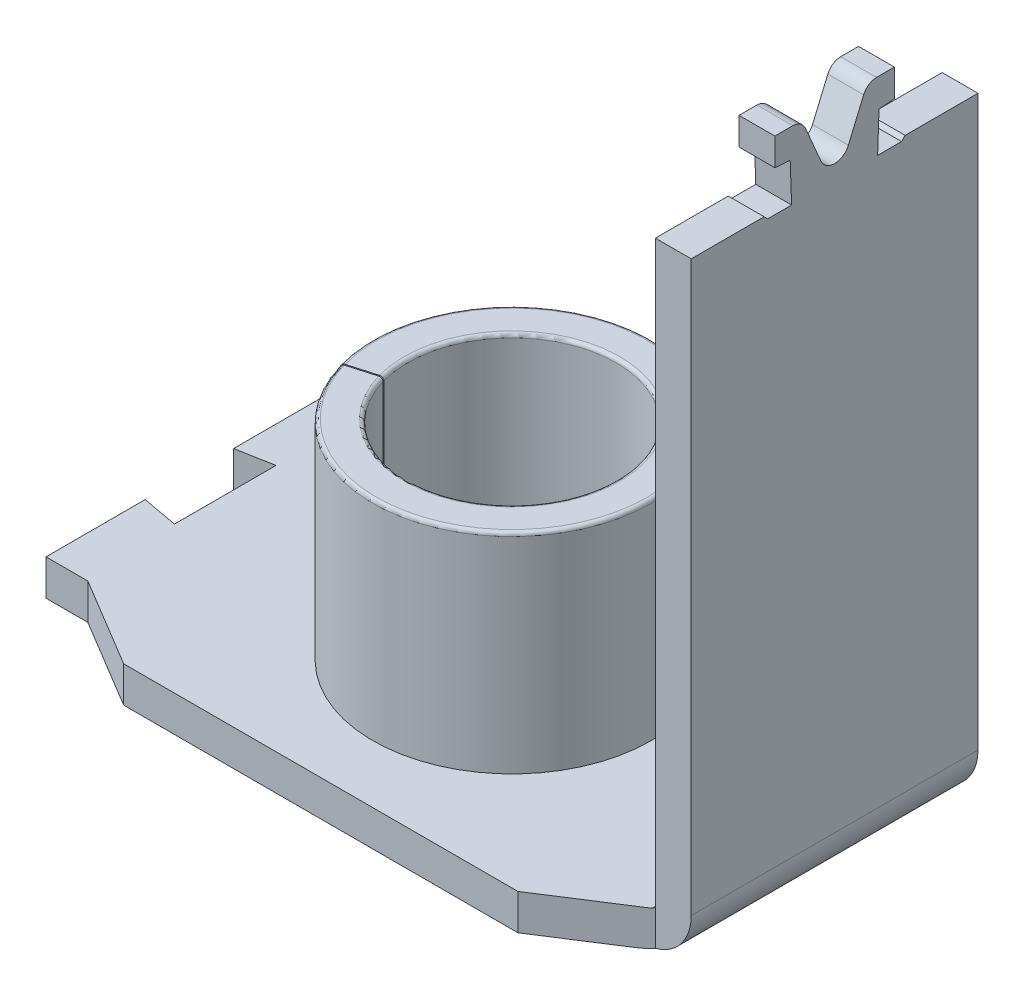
from build123d import *

# Parameters (mm, degrees)
EXTRUSION1_DEPTH             = 16.5
ENL_V_MAT_EXTRU_1_DEPTH      = 79.129699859
ENL_V_MAT_EXTRU_1_DEPTH_BACK = 33
ESQUISSE2_OUTSIDE_W          = 73.034
ESQUISSE2_OUTSIDE_H          = 52.034
ESQUISSE2_OUTSIDE_R          = 11.65
ENL_V_MAT_EXTRU_2_DEPTH      = 79.244808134
EXTRUSION2_START             = -20.5
ESQUISSE5_R                  = 11.65
ESQUISSE5_R_2                = 8.725
EXTRUSION2_DEPTH             = 20.5
CONG_1_R                     = 0.3
ENL_V_START                  = -0.5
ESQUISSE6_R                  = 11.65
ESQUISSE6_R_2                = 11.6
ENL_V_MAT_EXTRU_3_DEPTH      = 0.5
ENL_V_MAT_EXTRU_4_DEPTH      = 81.232474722


with BuildPart() as part:
    # Esquisse1 → Extrusion1 (new, symmetric)
    with BuildSketch(Plane.XY):
        with BuildLine():
            Line((-4, 0), (-54, 0))
            Line((-54, 0), (-54, 3))
            Line((-54, 3), (-3.2, 3))
            ThreePointArc((-3.2, 3), (-3.058578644, 3.058578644), (-3, 3.2))
            Line((-3, 3.2), (-3, 57))
            Line((-3, 57), (0, 57))
            Line((0, 57), (0, 4))
            ThreePointArc((0, 4), (-1.171572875, 1.171572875), (-4, 0))
        make_face()
    extrude(amount=EXTRUSION1_DEPTH, both=True)

    # Esquisse2 outside → Enl_v. mat.-Extru.1 (cut, two sides: drawn at the far end of the back side and taken through both)
    # profile 1 of 2: a face of its own
    with BuildSketch(Plane(origin=(0, 3, 0), x_dir=(-1, 0, 0), z_dir=(0, 1, 0)).offset(-ENL_V_MAT_EXTRU_1_DEPTH_BACK)):
        with Locations((27, 0)):
            Rectangle(ESQUISSE2_OUTSIDE_W, ESQUISSE2_OUTSIDE_H)
        Polygon((3, -12), (10, -16.5), (43, -16.5), (50.49790411, -12), (57, -12), (57, -3.7), (54, -3.7), (51, -4.25), (51, 4.25), (54, 3.7), (57, 3.7), (57, 12), (50.49790411, 12), (43, 16.5), (10, 16.5), (3, 12), (0, 12), (0, -12), align=None, mode=Mode.SUBTRACT)
    # profile 2 of 2: a face of its own
    with BuildSketch(Plane(origin=(0, 3, 0), x_dir=(-1, 0, 0), z_dir=(0, 1, 0)).offset(-ENL_V_MAT_EXTRU_1_DEPTH_BACK)):
        with Locations(Location((27, 0, 0), (0, 0, 180))):
            Circle(ESQUISSE2_OUTSIDE_R)
    extrude(amount=ENL_V_MAT_EXTRU_1_DEPTH + ENL_V_MAT_EXTRU_1_DEPTH_BACK, mode=Mode.SUBTRACT)

    # Esquisse3 → Enl_v. mat.-Extru.2 (cut, through all)
    with BuildSketch(Plane.ZY.offset(3)):
        Polygon((3.6, 51.3), (3.715789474, 54.6), (5, 54.7), (5, 57), (12, 57), (12, 51.6), (5.9, 51.6), (5.6, 51.3), align=None)
        with BuildLine():
            Line((-3.5, 61.507573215), (3.5, 61.507573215))
            Line((3.5, 61.507573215), (3.5, 57))
            ThreePointArc((3.5, 57), (2.858794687, 56.791647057), (2.431138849, 56.270431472))
            Line((2.431138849, 56.270431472), (1.150172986, 53.260508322))
            ThreePointArc((1.150172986, 53.260508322), (0, 52.5), (-1.150172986, 53.260508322))
            Line((-1.150172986, 53.260508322), (-2.431138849, 56.270431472))
            ThreePointArc((-2.431138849, 56.270431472), (-2.858794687, 56.791647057), (-3.5, 57))
            Line((-3.5, 57), (-3.5, 61.507573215))
        make_face()
        Polygon((-5, 54.7), (-5, 57), (-12, 57), (-12, 51.6), (-5.9, 51.6), (-5.6, 51.3), (-3.6, 51.3), (-3.715789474, 54.6), align=None)
    extrude(amount=-ENL_V_MAT_EXTRU_2_DEPTH, mode=Mode.SUBTRACT)

    # Esquisse5 → Extrusion2 (add)
    with BuildSketch(Plane.XZ.offset(EXTRUSION2_START)):
        with Locations((-27, 0)):
            Circle(ESQUISSE5_R)
        with Locations((-27, 0)):
            Circle(ESQUISSE5_R_2, mode=Mode.SUBTRACT)
    extrude(amount=EXTRUSION2_DEPTH)

    # Cong_1
    cong_1_edges = [part.edges().sort_by_distance(p)[0] for p in [
        (-38.65, 20.5, 0),
        (-35.725, 20.5, 0),
        (-35.725, 0, 0),
    ]]
    fillet(cong_1_edges, radius=CONG_1_R)

    # Esquisse6 → Enl_v. mat.-Extru.3 (cut)
    with BuildSketch(Plane.XZ.offset(ENL_V_START)):
        with Locations((-27, 0)):
            Circle(ESQUISSE6_R)
        with Locations((-27, 0)):
            Circle(ESQUISSE6_R_2, mode=Mode.SUBTRACT)
    extrude(amount=ENL_V_MAT_EXTRU_3_DEPTH, mode=Mode.SUBTRACT)

    # Esquisse7 → Enl_v. mat.-Extru.4 (cut, through all)
    with BuildSketch(Plane.XZ):
        Polygon((-38.151937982, 3.192848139), (-35.34809845, 2.390096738), (-35.375623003, 2.293959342), (-38.179462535, 3.096710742), align=None)
    extrude(amount=-ENL_V_MAT_EXTRU_4_DEPTH, mode=Mode.SUBTRACT)


solid = part.part
